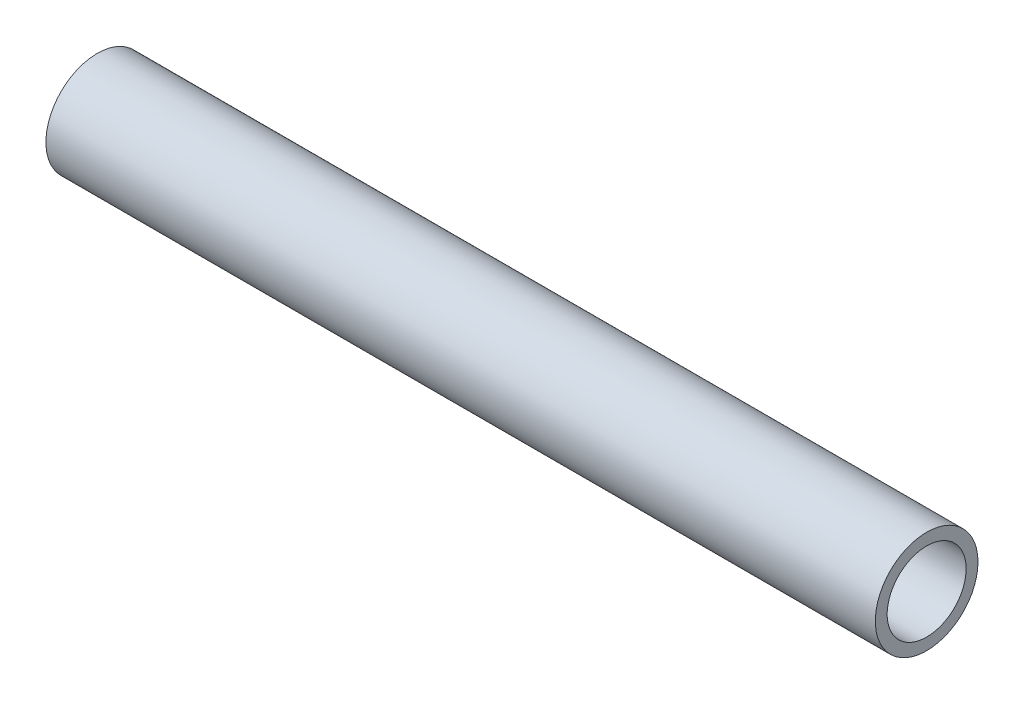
ISO-10303-21;
HEADER;
FILE_DESCRIPTION(('STEP AP214'),'2;1');
FILE_NAME('part.step','',(''),(''),'','','');
FILE_SCHEMA(('AUTOMOTIVE_DESIGN { 1 0 10303 214 1 1 1 1 }'));
ENDSEC;
DATA;
#1=APPLICATION_CONTEXT('core data for automotive mechanical design processes');
#2=APPLICATION_PROTOCOL_DEFINITION('international standard','automotive_design',2000,#1);
#3=PRODUCT_CONTEXT('',#1,'mechanical');
#4=PRODUCT('Part','Part','',(#3));
#5=PRODUCT_RELATED_PRODUCT_CATEGORY('part','',(#4));
#6=PRODUCT_DEFINITION_FORMATION('','',#4);
#7=PRODUCT_DEFINITION_CONTEXT('part definition',#1,'design');
#8=PRODUCT_DEFINITION('design','',#6,#7);
#9=PRODUCT_DEFINITION_SHAPE('','',#8);
#10=(LENGTH_UNIT() NAMED_UNIT(*) SI_UNIT(.MILLI.,.METRE.));
#11=(NAMED_UNIT(*) PLANE_ANGLE_UNIT() SI_UNIT($,.RADIAN.));
#12=(NAMED_UNIT(*) SI_UNIT($,.STERADIAN.) SOLID_ANGLE_UNIT());
#13=UNCERTAINTY_MEASURE_WITH_UNIT(LENGTH_MEASURE(1.E-05),#10,'distance_accuracy_value','');
#14=(GEOMETRIC_REPRESENTATION_CONTEXT(3) GLOBAL_UNCERTAINTY_ASSIGNED_CONTEXT((#13)) GLOBAL_UNIT_ASSIGNED_CONTEXT((#10,
#11,#12)) REPRESENTATION_CONTEXT('',''));
#15=CARTESIAN_POINT('',(0.,0.,0.));
#16=DIRECTION('',(0.,0.,1.));
#17=DIRECTION('',(1.,0.,0.));
#18=AXIS2_PLACEMENT_3D('',#15,#16,#17);
#19=CARTESIAN_POINT('',(266.7,0.,0.));
#20=DIRECTION('',(-1.,0.,0.));
#21=DIRECTION('',(0.,0.,1.));
#22=AXIS2_PLACEMENT_3D('',#19,#20,#21);
#23=CYLINDRICAL_SURFACE('',#22,12.7);
#24=CARTESIAN_POINT('',(266.7,0.,0.));
#25=DIRECTION('',(1.,0.,0.));
#26=DIRECTION('',(0.,0.,-1.));
#27=AXIS2_PLACEMENT_3D('',#24,#25,#26);
#28=CIRCLE('',#27,12.7);
#29=CARTESIAN_POINT('',(266.7,0.,-12.7));
#30=VERTEX_POINT('',#29);
#31=EDGE_CURVE('E53',#30,#30,#28,.T.);
#32=ORIENTED_EDGE('',*,*,#31,.T.);
#33=EDGE_LOOP('',(#32));
#34=FACE_BOUND('',#33,.T.);
#35=CARTESIAN_POINT('',(0.,0.,0.));
#36=DIRECTION('',(1.,0.,0.));
#37=DIRECTION('',(0.,0.,-1.));
#38=AXIS2_PLACEMENT_3D('',#35,#36,#37);
#39=CIRCLE('',#38,12.7);
#40=CARTESIAN_POINT('',(0.,0.,-12.7));
#41=VERTEX_POINT('',#40);
#42=EDGE_CURVE('E60',#41,#41,#39,.T.);
#43=ORIENTED_EDGE('',*,*,#42,.F.);
#44=EDGE_LOOP('',(#43));
#45=FACE_BOUND('',#44,.T.);
#46=ADVANCED_FACE('F45',(#34,#45),#23,.F.);
#47=CARTESIAN_POINT('',(266.7,0.,0.));
#48=DIRECTION('',(-1.,0.,0.));
#49=DIRECTION('',(0.,0.,1.));
#50=AXIS2_PLACEMENT_3D('',#47,#48,#49);
#51=CYLINDRICAL_SURFACE('',#50,16.51);
#52=CARTESIAN_POINT('',(266.7,0.,0.));
#53=DIRECTION('',(1.,0.,0.));
#54=DIRECTION('',(0.,0.,-1.));
#55=AXIS2_PLACEMENT_3D('',#52,#53,#54);
#56=CIRCLE('',#55,16.51);
#57=CARTESIAN_POINT('',(266.7,0.,-16.51));
#58=VERTEX_POINT('',#57);
#59=EDGE_CURVE('E10',#58,#58,#56,.T.);
#60=ORIENTED_EDGE('',*,*,#59,.F.);
#61=EDGE_LOOP('',(#60));
#62=FACE_BOUND('',#61,.T.);
#63=CARTESIAN_POINT('',(0.,0.,0.));
#64=DIRECTION('',(1.,0.,0.));
#65=DIRECTION('',(0.,0.,-1.));
#66=AXIS2_PLACEMENT_3D('',#63,#64,#65);
#67=CIRCLE('',#66,16.51);
#68=CARTESIAN_POINT('',(0.,0.,-16.51));
#69=VERTEX_POINT('',#68);
#70=EDGE_CURVE('E48',#69,#69,#67,.T.);
#71=ORIENTED_EDGE('',*,*,#70,.T.);
#72=EDGE_LOOP('',(#71));
#73=FACE_BOUND('',#72,.T.);
#74=ADVANCED_FACE('F69',(#62,#73),#51,.T.);
#75=CARTESIAN_POINT('',(266.7,0.,0.));
#76=DIRECTION('',(1.,0.,0.));
#77=DIRECTION('',(0.,0.,-1.));
#78=AXIS2_PLACEMENT_3D('',#75,#76,#77);
#79=PLANE('',#78);
#80=ORIENTED_EDGE('',*,*,#31,.F.);
#81=EDGE_LOOP('',(#80));
#82=FACE_BOUND('',#81,.T.);
#83=ORIENTED_EDGE('',*,*,#59,.T.);
#84=EDGE_LOOP('',(#83));
#85=FACE_BOUND('',#84,.T.);
#86=ADVANCED_FACE('F73',(#82,#85),#79,.T.);
#87=CARTESIAN_POINT('',(0.,0.,0.));
#88=DIRECTION('',(1.,0.,0.));
#89=DIRECTION('',(0.,0.,-1.));
#90=AXIS2_PLACEMENT_3D('',#87,#88,#89);
#91=PLANE('',#90);
#92=ORIENTED_EDGE('',*,*,#42,.T.);
#93=EDGE_LOOP('',(#92));
#94=FACE_BOUND('',#93,.T.);
#95=ORIENTED_EDGE('',*,*,#70,.F.);
#96=EDGE_LOOP('',(#95));
#97=FACE_BOUND('',#96,.T.);
#98=ADVANCED_FACE('F71',(#94,#97),#91,.F.);
#99=CLOSED_SHELL('',(#46,#74,#86,#98));
#100=MANIFOLD_SOLID_BREP('B2',#99);
#101=ADVANCED_BREP_SHAPE_REPRESENTATION('',(#18,#100),#14);
#102=SHAPE_DEFINITION_REPRESENTATION(#9,#101);
ENDSEC;
END-ISO-10303-21;
